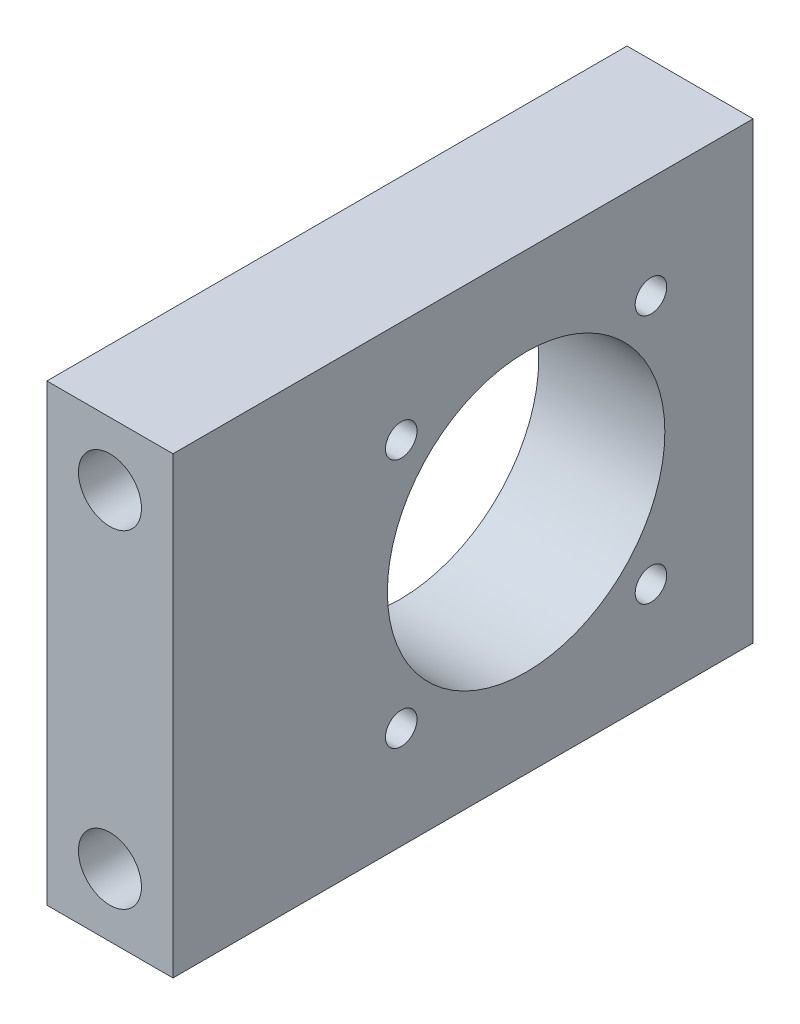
from build123d import *

# Parameters (mm, degrees)
SKETCH1_W                 = 46
SKETCH1_H                 = 36
SKETCH1_R                 = 11
BOSS_EXTRUDE1_DEPTH       = 10
M6X1_0_TAPPED_HOLE1_D     = 5
M6X1_0_TAPPED_HOLE1_DEPTH = 15
M6X1_0_TAPPED_HOLE1_TIP   = 1.502151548
M3X0_5_TAPPED_HOLE1_D     = 2.5


with BuildPart() as part:
    # Sketch1 → Boss-Extrude1 (new body)
    with BuildSketch(Plane(origin=(0, 0, 0), x_dir=(0, 0, -1), z_dir=(1, 0, 0))):
        with Locations((-5, 0)):
            Rectangle(SKETCH1_W, SKETCH1_H)
        Circle(SKETCH1_R, mode=Mode.SUBTRACT)
    extrude(amount=BOSS_EXTRUDE1_DEPTH)

    # M6x1.0 Tapped Hole1
    with Locations(Plane.XY.offset(28)):
        with Locations((5, 13), (5, -13)):
            Hole(M6X1_0_TAPPED_HOLE1_D / 2, depth=M6X1_0_TAPPED_HOLE1_DEPTH)
            with Locations((0, 0, -(M6X1_0_TAPPED_HOLE1_DEPTH + M6X1_0_TAPPED_HOLE1_TIP / 2))):  # 118° drill point
                Cone(0, M6X1_0_TAPPED_HOLE1_D / 2, M6X1_0_TAPPED_HOLE1_TIP, mode=Mode.SUBTRACT)

    # M3x0.5 Tapped Hole1 (through all)
    with Locations(Plane(origin=(10, 0, 0), x_dir=(0, 0, -1), z_dir=(1, 0, 0))):
        with Locations((9.899494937, -9.899494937), (-9.899494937, -9.899494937), (-9.899494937, 9.899494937), (9.899494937, 9.899494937)):
            Hole(M3X0_5_TAPPED_HOLE1_D / 2)


solid = part.part
